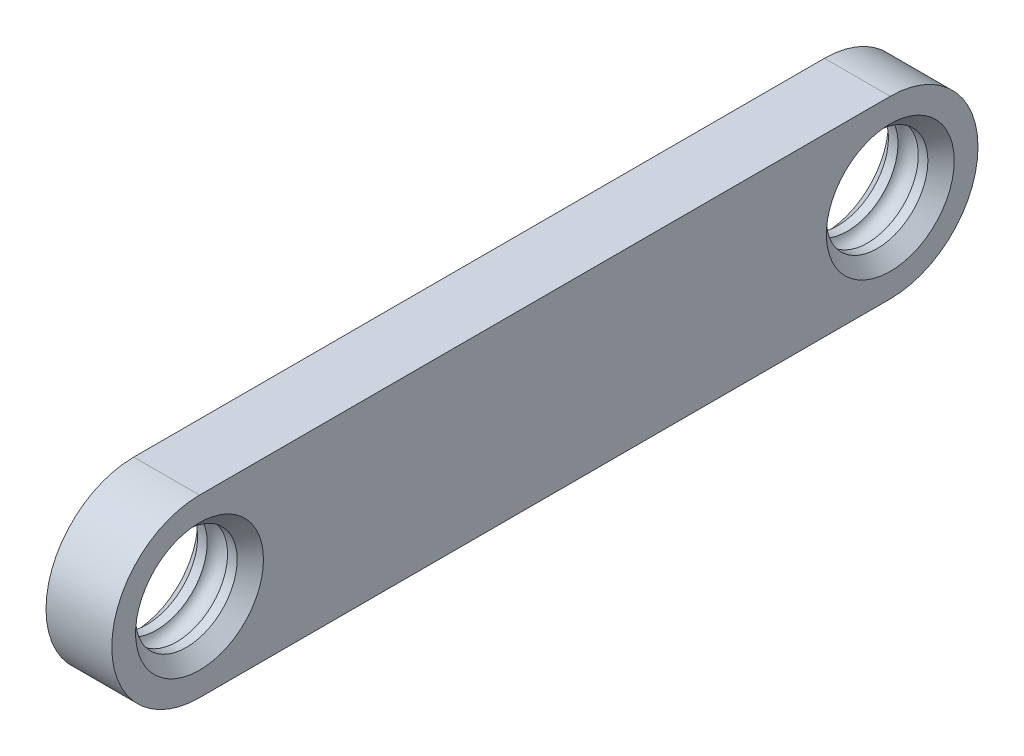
from build123d import *

# Parameters (mm, degrees)
SKETCH1_R           = 3.675
BOSS_EXTRUDE1_DEPTH = 4.7625
CHAMFER1_SIZE       = 0.9525
SKETCH2_R           = 0.79375


with BuildPart() as part:
    # Sketch1 → Boss-Extrude1 (new body)
    with BuildSketch(Plane(origin=(0, 0, 0), x_dir=(0, 0, -1), z_dir=(1, 0, 0))):
        with BuildLine():
            Line((0, 6.35), (50, 6.35))
            ThreePointArc((50, 6.35), (56.35, 0), (50, -6.35))
            Line((50, -6.35), (0, -6.35))
            ThreePointArc((0, -6.35), (-6.35, 0), (0, 6.35))
        make_face()
        with Locations(Location((0, 0, 0), (0, 0, 180))):
            Circle(SKETCH1_R, mode=Mode.SUBTRACT)
        with Locations(Location((50, 0, 0), (0, 0, 180))):
            Circle(SKETCH1_R, mode=Mode.SUBTRACT)
    extrude(amount=BOSS_EXTRUDE1_DEPTH)

    # Chamfer1
    chamfer1_edges = [part.edges().sort_by_distance(p)[0] for p in [
        (0, 0, -3.675),
        (0, 0, -53.675),
        (4.7625, 0, -3.675),
        (4.7625, 0, -53.675),
    ]]
    chamfer(chamfer1_edges, length=CHAMFER1_SIZE)

    # Sketch2 → Cut-Revolve1 (revolve, cut)
    with BuildSketch(Plane(origin=(0, 0, 0), x_dir=(1, 0, 0), z_dir=(0, 1, 0))):
        with Locations((2.38125, -3.375)):
            Circle(SKETCH2_R)
    cut_revolve1 = revolve(axis=Axis((0.4525, 0, 0), (1, 0, 0)), mode=Mode.SUBTRACT)

    # Sketch-Pattern2: Cut-Revolve1 at 1 more place
    with Locations((0, 0, -50)):
        add(cut_revolve1, mode=Mode.SUBTRACT)


solid = part.part
